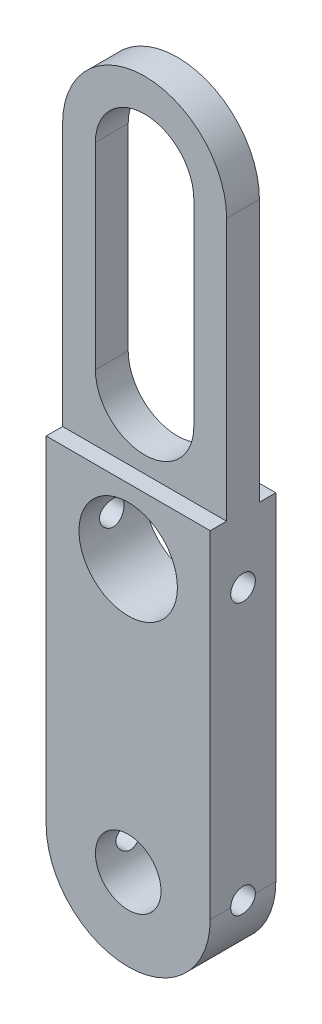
ISO-10303-21;
HEADER;
FILE_DESCRIPTION(('STEP AP214'),'2;1');
FILE_NAME('part.step','',(''),(''),'','','');
FILE_SCHEMA(('AUTOMOTIVE_DESIGN { 1 0 10303 214 1 1 1 1 }'));
ENDSEC;
DATA;
#1=APPLICATION_CONTEXT('core data for automotive mechanical design processes');
#2=APPLICATION_PROTOCOL_DEFINITION('international standard','automotive_design',2000,#1);
#3=PRODUCT_CONTEXT('',#1,'mechanical');
#4=PRODUCT('Part','Part','',(#3));
#5=PRODUCT_RELATED_PRODUCT_CATEGORY('part','',(#4));
#6=PRODUCT_DEFINITION_FORMATION('','',#4);
#7=PRODUCT_DEFINITION_CONTEXT('part definition',#1,'design');
#8=PRODUCT_DEFINITION('design','',#6,#7);
#9=PRODUCT_DEFINITION_SHAPE('','',#8);
#10=(LENGTH_UNIT() NAMED_UNIT(*) SI_UNIT(.MILLI.,.METRE.));
#11=(NAMED_UNIT(*) PLANE_ANGLE_UNIT() SI_UNIT($,.RADIAN.));
#12=(NAMED_UNIT(*) SI_UNIT($,.STERADIAN.) SOLID_ANGLE_UNIT());
#13=UNCERTAINTY_MEASURE_WITH_UNIT(LENGTH_MEASURE(1.E-05),#10,'distance_accuracy_value','');
#14=(GEOMETRIC_REPRESENTATION_CONTEXT(3) GLOBAL_UNCERTAINTY_ASSIGNED_CONTEXT((#13)) GLOBAL_UNIT_ASSIGNED_CONTEXT((#10,
#11,#12)) REPRESENTATION_CONTEXT('',''));
#15=CARTESIAN_POINT('',(0.,0.,0.));
#16=DIRECTION('',(0.,0.,1.));
#17=DIRECTION('',(1.,0.,0.));
#18=AXIS2_PLACEMENT_3D('',#15,#16,#17);
#19=CARTESIAN_POINT('',(0.,31.75,3.175));
#20=DIRECTION('',(0.,0.,1.));
#21=DIRECTION('',(1.,0.,0.));
#22=AXIS2_PLACEMENT_3D('',#19,#20,#21);
#23=PLANE('',#22);
#24=CARTESIAN_POINT('',(0.,0.,3.175));
#25=DIRECTION('',(0.,0.,1.));
#26=DIRECTION('',(1.,0.,0.));
#27=AXIS2_PLACEMENT_3D('',#24,#25,#26);
#28=CIRCLE('',#27,4.7625);
#29=CARTESIAN_POINT('',(4.7625,0.,3.175));
#30=VERTEX_POINT('',#29);
#31=EDGE_CURVE('E287',#30,#30,#28,.T.);
#32=ORIENTED_EDGE('',*,*,#31,.F.);
#33=EDGE_LOOP('',(#32));
#34=FACE_BOUND('',#33,.T.);
#35=CARTESIAN_POINT('',(0.,-26.2382,3.175));
#36=DIRECTION('',(0.,0.,1.));
#37=DIRECTION('',(1.,0.,0.));
#38=AXIS2_PLACEMENT_3D('',#35,#36,#37);
#39=CIRCLE('',#38,3.175);
#40=CARTESIAN_POINT('',(3.175,-26.2382,3.175));
#41=VERTEX_POINT('',#40);
#42=EDGE_CURVE('E288',#41,#41,#39,.T.);
#43=ORIENTED_EDGE('',*,*,#42,.F.);
#44=EDGE_LOOP('',(#43));
#45=FACE_BOUND('',#44,.T.);
#46=DIRECTION('',(0.,1.,0.));
#47=VECTOR('',#46,1.);
#48=CARTESIAN_POINT('',(7.93749999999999,31.75,3.175));
#49=LINE('',#48,#47);
#50=CARTESIAN_POINT('',(7.93749999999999,-26.2382,3.175));
#51=VERTEX_POINT('',#50);
#52=CARTESIAN_POINT('',(7.93749999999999,6.35000000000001,3.175));
#53=VERTEX_POINT('',#52);
#54=EDGE_CURVE('E306',#51,#53,#49,.T.);
#55=ORIENTED_EDGE('',*,*,#54,.T.);
#56=DIRECTION('',(-1.,0.,0.));
#57=VECTOR('',#56,1.);
#58=CARTESIAN_POINT('',(0.,6.35,3.175));
#59=LINE('',#58,#57);
#60=CARTESIAN_POINT('',(-7.9375,6.35,3.175));
#61=VERTEX_POINT('',#60);
#62=EDGE_CURVE('E322',#53,#61,#59,.T.);
#63=ORIENTED_EDGE('',*,*,#62,.T.);
#64=DIRECTION('',(0.,-1.,0.));
#65=VECTOR('',#64,1.);
#66=CARTESIAN_POINT('',(-7.9375,31.75,3.175));
#67=LINE('',#66,#65);
#68=CARTESIAN_POINT('',(-7.93749999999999,-26.2382,3.175));
#69=VERTEX_POINT('',#68);
#70=EDGE_CURVE('E303',#61,#69,#67,.T.);
#71=ORIENTED_EDGE('',*,*,#70,.T.);
#72=CARTESIAN_POINT('',(0.,-26.2382,3.175));
#73=DIRECTION('',(0.,0.,1.));
#74=DIRECTION('',(1.,0.,0.));
#75=AXIS2_PLACEMENT_3D('',#72,#73,#74);
#76=CIRCLE('',#75,7.93749999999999);
#77=EDGE_CURVE('E160',#69,#51,#76,.T.);
#78=ORIENTED_EDGE('',*,*,#77,.T.);
#79=EDGE_LOOP('',(#55,#63,#71,#78));
#80=FACE_BOUND('',#79,.T.);
#81=ADVANCED_FACE('F36',(#34,#45,#80),#23,.T.);
#82=CARTESIAN_POINT('',(0.,31.75,3.175));
#83=DIRECTION('',(0.,0.,-1.));
#84=DIRECTION('',(-1.,0.,0.));
#85=AXIS2_PLACEMENT_3D('',#82,#83,#84);
#86=CYLINDRICAL_SURFACE('',#85,7.9375);
#87=CARTESIAN_POINT('',(0.,31.75,1.5875));
#88=DIRECTION('',(0.,0.,1.));
#89=DIRECTION('',(0.,-1.,0.));
#90=AXIS2_PLACEMENT_3D('',#87,#88,#89);
#91=CIRCLE('',#90,7.9375);
#92=CARTESIAN_POINT('',(7.9375,31.75,1.5875));
#93=VERTEX_POINT('',#92);
#94=CARTESIAN_POINT('',(-7.9375,31.75,1.5875));
#95=VERTEX_POINT('',#94);
#96=EDGE_CURVE('E344',#93,#95,#91,.T.);
#97=ORIENTED_EDGE('',*,*,#96,.F.);
#98=DIRECTION('',(0.,0.,-1.));
#99=VECTOR('',#98,1.);
#100=CARTESIAN_POINT('',(7.93749999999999,31.75,3.175));
#101=LINE('',#100,#99);
#102=CARTESIAN_POINT('',(7.9375,31.75,-1.5875));
#103=VERTEX_POINT('',#102);
#104=EDGE_CURVE('E308',#93,#103,#101,.T.);
#105=ORIENTED_EDGE('',*,*,#104,.T.);
#106=CARTESIAN_POINT('',(0.,31.75,-1.5875));
#107=DIRECTION('',(0.,0.,1.));
#108=DIRECTION('',(0.,-1.,0.));
#109=AXIS2_PLACEMENT_3D('',#106,#107,#108);
#110=CIRCLE('',#109,7.9375);
#111=CARTESIAN_POINT('',(-7.9375,31.75,-1.5875));
#112=VERTEX_POINT('',#111);
#113=EDGE_CURVE('E369',#103,#112,#110,.T.);
#114=ORIENTED_EDGE('',*,*,#113,.T.);
#115=DIRECTION('',(0.,0.,-1.));
#116=VECTOR('',#115,1.);
#117=CARTESIAN_POINT('',(-7.9375,31.75,3.175));
#118=LINE('',#117,#116);
#119=EDGE_CURVE('E161',#95,#112,#118,.T.);
#120=ORIENTED_EDGE('',*,*,#119,.F.);
#121=EDGE_LOOP('',(#97,#105,#114,#120));
#122=FACE_BOUND('',#121,.T.);
#123=ADVANCED_FACE('F38',(#122),#86,.T.);
#124=CARTESIAN_POINT('',(-7.9375,31.75,3.175));
#125=DIRECTION('',(1.,0.,0.));
#126=DIRECTION('',(0.,1.,0.));
#127=AXIS2_PLACEMENT_3D('',#124,#125,#126);
#128=PLANE('',#127);
#129=CARTESIAN_POINT('',(-7.9375,0.,0.));
#130=DIRECTION('',(1.,0.,0.));
#131=DIRECTION('',(0.,0.,-1.));
#132=AXIS2_PLACEMENT_3D('',#129,#130,#131);
#133=CIRCLE('',#132,1.190625);
#134=CARTESIAN_POINT('',(-7.9375,0.,-1.190625));
#135=VERTEX_POINT('',#134);
#136=EDGE_CURVE('E178',#135,#135,#133,.T.);
#137=ORIENTED_EDGE('',*,*,#136,.T.);
#138=EDGE_LOOP('',(#137));
#139=FACE_BOUND('',#138,.T.);
#140=DIRECTION('',(0.,0.,-1.));
#141=VECTOR('',#140,1.);
#142=CARTESIAN_POINT('',(-7.93749999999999,-26.2382,3.175));
#143=LINE('',#142,#141);
#144=CARTESIAN_POINT('',(-7.93749999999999,-26.2382,-1.190625));
#145=VERTEX_POINT('',#144);
#146=CARTESIAN_POINT('',(-7.93749999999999,-26.2382,-3.175));
#147=VERTEX_POINT('',#146);
#148=EDGE_CURVE('E155',#145,#147,#143,.T.);
#149=ORIENTED_EDGE('',*,*,#148,.F.);
#150=CARTESIAN_POINT('',(-7.9375,-26.2382,0.));
#151=DIRECTION('',(1.,0.,0.));
#152=DIRECTION('',(0.,0.,-1.));
#153=AXIS2_PLACEMENT_3D('',#150,#151,#152);
#154=CIRCLE('',#153,1.190625);
#155=CARTESIAN_POINT('',(-7.9375,-26.2382,1.190625));
#156=VERTEX_POINT('',#155);
#157=EDGE_CURVE('E56',#145,#156,#154,.T.);
#158=ORIENTED_EDGE('',*,*,#157,.T.);
#159=EDGE_CURVE('E152',#69,#156,#143,.T.);
#160=ORIENTED_EDGE('',*,*,#159,.F.);
#161=ORIENTED_EDGE('',*,*,#70,.F.);
#162=DIRECTION('',(0.,0.,1.));
#163=VECTOR('',#162,1.);
#164=CARTESIAN_POINT('',(-7.9375,6.35,1.5875));
#165=LINE('',#164,#163);
#166=CARTESIAN_POINT('',(-7.9375,6.35,1.5875));
#167=VERTEX_POINT('',#166);
#168=EDGE_CURVE('E325',#167,#61,#165,.T.);
#169=ORIENTED_EDGE('',*,*,#168,.F.);
#170=DIRECTION('',(0.,-1.,0.));
#171=VECTOR('',#170,1.);
#172=CARTESIAN_POINT('',(-7.9375,44.45,1.58749999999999));
#173=LINE('',#172,#171);
#174=EDGE_CURVE('E326',#95,#167,#173,.T.);
#175=ORIENTED_EDGE('',*,*,#174,.F.);
#176=ORIENTED_EDGE('',*,*,#119,.T.);
#177=DIRECTION('',(0.,-1.,0.));
#178=VECTOR('',#177,1.);
#179=CARTESIAN_POINT('',(-7.9375,44.45,-1.58749999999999));
#180=LINE('',#179,#178);
#181=CARTESIAN_POINT('',(-7.9375,6.35,-1.5875));
#182=VERTEX_POINT('',#181);
#183=EDGE_CURVE('E352',#112,#182,#180,.T.);
#184=ORIENTED_EDGE('',*,*,#183,.T.);
#185=DIRECTION('',(0.,0.,-1.));
#186=VECTOR('',#185,1.);
#187=CARTESIAN_POINT('',(-7.9375,6.35,-1.5875));
#188=LINE('',#187,#186);
#189=CARTESIAN_POINT('',(-7.9375,6.35,-3.175));
#190=VERTEX_POINT('',#189);
#191=EDGE_CURVE('E355',#182,#190,#188,.T.);
#192=ORIENTED_EDGE('',*,*,#191,.T.);
#193=DIRECTION('',(0.,-1.,0.));
#194=VECTOR('',#193,1.);
#195=CARTESIAN_POINT('',(-7.9375,31.75,-3.175));
#196=LINE('',#195,#194);
#197=EDGE_CURVE('E282',#190,#147,#196,.T.);
#198=ORIENTED_EDGE('',*,*,#197,.T.);
#199=EDGE_LOOP('',(#149,#158,#160,#161,#169,#175,#176,#184,#192,#198));
#200=FACE_BOUND('',#199,.T.);
#201=ADVANCED_FACE('F150',(#139,#200),#128,.F.);
#202=CARTESIAN_POINT('',(7.93749999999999,31.75,3.175));
#203=DIRECTION('',(-1.,0.,0.));
#204=DIRECTION('',(0.,-1.,0.));
#205=AXIS2_PLACEMENT_3D('',#202,#203,#204);
#206=PLANE('',#205);
#207=CARTESIAN_POINT('',(7.9375,0.,0.));
#208=DIRECTION('',(1.,0.,0.));
#209=DIRECTION('',(0.,0.,-1.));
#210=AXIS2_PLACEMENT_3D('',#207,#208,#209);
#211=CIRCLE('',#210,1.190625);
#212=CARTESIAN_POINT('',(7.9375,0.,-1.190625));
#213=VERTEX_POINT('',#212);
#214=EDGE_CURVE('E145',#213,#213,#211,.T.);
#215=ORIENTED_EDGE('',*,*,#214,.F.);
#216=EDGE_LOOP('',(#215));
#217=FACE_BOUND('',#216,.T.);
#218=DIRECTION('',(0.,0.,-1.));
#219=VECTOR('',#218,1.);
#220=CARTESIAN_POINT('',(7.93749999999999,-26.2382,3.175));
#221=LINE('',#220,#219);
#222=CARTESIAN_POINT('',(7.93749999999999,-26.2382,1.190625));
#223=VERTEX_POINT('',#222);
#224=EDGE_CURVE('E164',#51,#223,#221,.T.);
#225=ORIENTED_EDGE('',*,*,#224,.T.);
#226=CARTESIAN_POINT('',(7.9375,-26.2382,0.));
#227=DIRECTION('',(1.,0.,0.));
#228=DIRECTION('',(0.,0.,-1.));
#229=AXIS2_PLACEMENT_3D('',#226,#227,#228);
#230=CIRCLE('',#229,1.190625);
#231=CARTESIAN_POINT('',(7.9375,-26.2382,-1.190625));
#232=VERTEX_POINT('',#231);
#233=EDGE_CURVE('E63',#232,#223,#230,.T.);
#234=ORIENTED_EDGE('',*,*,#233,.F.);
#235=CARTESIAN_POINT('',(7.93749999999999,-26.2382,-3.175));
#236=VERTEX_POINT('',#235);
#237=EDGE_CURVE('E309',#232,#236,#221,.T.);
#238=ORIENTED_EDGE('',*,*,#237,.T.);
#239=DIRECTION('',(0.,1.,0.));
#240=VECTOR('',#239,1.);
#241=CARTESIAN_POINT('',(7.93749999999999,31.75,-3.175));
#242=LINE('',#241,#240);
#243=CARTESIAN_POINT('',(7.9375,6.35,-3.175));
#244=VERTEX_POINT('',#243);
#245=EDGE_CURVE('E300',#236,#244,#242,.T.);
#246=ORIENTED_EDGE('',*,*,#245,.T.);
#247=DIRECTION('',(0.,0.,-1.));
#248=VECTOR('',#247,1.);
#249=CARTESIAN_POINT('',(7.9375,6.35,-1.5875));
#250=LINE('',#249,#248);
#251=CARTESIAN_POINT('',(7.93749999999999,6.35,-1.5875));
#252=VERTEX_POINT('',#251);
#253=EDGE_CURVE('E350',#252,#244,#250,.T.);
#254=ORIENTED_EDGE('',*,*,#253,.F.);
#255=DIRECTION('',(0.,-1.,0.));
#256=VECTOR('',#255,1.);
#257=CARTESIAN_POINT('',(7.9375,44.45,-1.58749999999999));
#258=LINE('',#257,#256);
#259=EDGE_CURVE('E347',#103,#252,#258,.T.);
#260=ORIENTED_EDGE('',*,*,#259,.F.);
#261=ORIENTED_EDGE('',*,*,#104,.F.);
#262=DIRECTION('',(0.,-1.,0.));
#263=VECTOR('',#262,1.);
#264=CARTESIAN_POINT('',(7.9375,44.45,1.58749999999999));
#265=LINE('',#264,#263);
#266=CARTESIAN_POINT('',(7.9375,6.35,1.5875));
#267=VERTEX_POINT('',#266);
#268=EDGE_CURVE('E390',#93,#267,#265,.T.);
#269=ORIENTED_EDGE('',*,*,#268,.T.);
#270=DIRECTION('',(0.,0.,1.));
#271=VECTOR('',#270,1.);
#272=CARTESIAN_POINT('',(7.9375,6.35,1.5875));
#273=LINE('',#272,#271);
#274=EDGE_CURVE('E319',#267,#53,#273,.T.);
#275=ORIENTED_EDGE('',*,*,#274,.T.);
#276=ORIENTED_EDGE('',*,*,#54,.F.);
#277=EDGE_LOOP('',(#225,#234,#238,#246,#254,#260,#261,#269,#275,#276));
#278=FACE_BOUND('',#277,.T.);
#279=ADVANCED_FACE('F224',(#217,#278),#206,.F.);
#280=CARTESIAN_POINT('',(0.,31.75,3.175));
#281=DIRECTION('',(0.,0.,-1.));
#282=DIRECTION('',(-1.,0.,0.));
#283=AXIS2_PLACEMENT_3D('',#280,#281,#282);
#284=CYLINDRICAL_SURFACE('',#283,4.7625);
#285=DIRECTION('',(0.,0.,-1.));
#286=VECTOR('',#285,1.);
#287=CARTESIAN_POINT('',(4.7625,31.75,3.175));
#288=LINE('',#287,#286);
#289=CARTESIAN_POINT('',(4.7625,31.75,1.5875));
#290=VERTEX_POINT('',#289);
#291=CARTESIAN_POINT('',(4.7625,31.75,-1.5875));
#292=VERTEX_POINT('',#291);
#293=EDGE_CURVE('E373',#290,#292,#288,.T.);
#294=ORIENTED_EDGE('',*,*,#293,.F.);
#295=CARTESIAN_POINT('',(0.,31.75,1.5875));
#296=DIRECTION('',(0.,0.,1.));
#297=DIRECTION('',(0.,-1.,0.));
#298=AXIS2_PLACEMENT_3D('',#295,#296,#297);
#299=CIRCLE('',#298,4.7625);
#300=CARTESIAN_POINT('',(-4.7625,31.75,1.5875));
#301=VERTEX_POINT('',#300);
#302=EDGE_CURVE('E341',#290,#301,#299,.T.);
#303=ORIENTED_EDGE('',*,*,#302,.T.);
#304=DIRECTION('',(0.,0.,-1.));
#305=VECTOR('',#304,1.);
#306=CARTESIAN_POINT('',(-4.7625,31.75,3.175));
#307=LINE('',#306,#305);
#308=CARTESIAN_POINT('',(-4.7625,31.75,-1.5875));
#309=VERTEX_POINT('',#308);
#310=EDGE_CURVE('E379',#301,#309,#307,.T.);
#311=ORIENTED_EDGE('',*,*,#310,.T.);
#312=CARTESIAN_POINT('',(0.,31.75,-1.5875));
#313=DIRECTION('',(0.,0.,1.));
#314=DIRECTION('',(0.,-1.,0.));
#315=AXIS2_PLACEMENT_3D('',#312,#313,#314);
#316=CIRCLE('',#315,4.7625);
#317=EDGE_CURVE('E366',#292,#309,#316,.T.);
#318=ORIENTED_EDGE('',*,*,#317,.F.);
#319=EDGE_LOOP('',(#294,#303,#311,#318));
#320=FACE_BOUND('',#319,.T.);
#321=ADVANCED_FACE('F221',(#320),#284,.F.);
#322=CARTESIAN_POINT('',(-4.7625,31.75,3.175));
#323=DIRECTION('',(1.,0.,0.));
#324=DIRECTION('',(0.,0.,-1.));
#325=AXIS2_PLACEMENT_3D('',#322,#323,#324);
#326=PLANE('',#325);
#327=ORIENTED_EDGE('',*,*,#310,.F.);
#328=DIRECTION('',(0.,-1.,0.));
#329=VECTOR('',#328,1.);
#330=CARTESIAN_POINT('',(-4.7625,31.75,1.5875));
#331=LINE('',#330,#329);
#332=CARTESIAN_POINT('',(-4.7625,12.7,1.5875));
#333=VERTEX_POINT('',#332);
#334=EDGE_CURVE('E338',#301,#333,#331,.T.);
#335=ORIENTED_EDGE('',*,*,#334,.T.);
#336=DIRECTION('',(0.,0.,-1.));
#337=VECTOR('',#336,1.);
#338=CARTESIAN_POINT('',(-4.7625,12.7,3.175));
#339=LINE('',#338,#337);
#340=CARTESIAN_POINT('',(-4.7625,12.7,-1.5875));
#341=VERTEX_POINT('',#340);
#342=EDGE_CURVE('E377',#333,#341,#339,.T.);
#343=ORIENTED_EDGE('',*,*,#342,.T.);
#344=DIRECTION('',(0.,-1.,0.));
#345=VECTOR('',#344,1.);
#346=CARTESIAN_POINT('',(-4.7625,31.75,-1.5875));
#347=LINE('',#346,#345);
#348=EDGE_CURVE('E363',#309,#341,#347,.T.);
#349=ORIENTED_EDGE('',*,*,#348,.F.);
#350=EDGE_LOOP('',(#327,#335,#343,#349));
#351=FACE_BOUND('',#350,.T.);
#352=ADVANCED_FACE('F217',(#351),#326,.T.);
#353=CARTESIAN_POINT('',(0.,12.7,3.175));
#354=DIRECTION('',(0.,0.,-1.));
#355=DIRECTION('',(-1.,0.,0.));
#356=AXIS2_PLACEMENT_3D('',#353,#354,#355);
#357=CYLINDRICAL_SURFACE('',#356,4.7625);
#358=ORIENTED_EDGE('',*,*,#342,.F.);
#359=CARTESIAN_POINT('',(0.,12.7,1.5875));
#360=DIRECTION('',(0.,0.,1.));
#361=DIRECTION('',(0.,-1.,0.));
#362=AXIS2_PLACEMENT_3D('',#359,#360,#361);
#363=CIRCLE('',#362,4.7625);
#364=CARTESIAN_POINT('',(4.7625,12.7,1.5875));
#365=VERTEX_POINT('',#364);
#366=EDGE_CURVE('E331',#333,#365,#363,.T.);
#367=ORIENTED_EDGE('',*,*,#366,.T.);
#368=DIRECTION('',(0.,0.,-1.));
#369=VECTOR('',#368,1.);
#370=CARTESIAN_POINT('',(4.7625,12.7,3.175));
#371=LINE('',#370,#369);
#372=CARTESIAN_POINT('',(4.7625,12.7,-1.5875));
#373=VERTEX_POINT('',#372);
#374=EDGE_CURVE('E375',#365,#373,#371,.T.);
#375=ORIENTED_EDGE('',*,*,#374,.T.);
#376=CARTESIAN_POINT('',(0.,12.7,-1.5875));
#377=DIRECTION('',(0.,0.,1.));
#378=DIRECTION('',(0.,-1.,0.));
#379=AXIS2_PLACEMENT_3D('',#376,#377,#378);
#380=CIRCLE('',#379,4.7625);
#381=EDGE_CURVE('E360',#341,#373,#380,.T.);
#382=ORIENTED_EDGE('',*,*,#381,.F.);
#383=EDGE_LOOP('',(#358,#367,#375,#382));
#384=FACE_BOUND('',#383,.T.);
#385=ADVANCED_FACE('F213',(#384),#357,.F.);
#386=CARTESIAN_POINT('',(4.7625,31.75,3.175));
#387=DIRECTION('',(-1.,0.,0.));
#388=DIRECTION('',(0.,0.,1.));
#389=AXIS2_PLACEMENT_3D('',#386,#387,#388);
#390=PLANE('',#389);
#391=ORIENTED_EDGE('',*,*,#374,.F.);
#392=DIRECTION('',(0.,1.,0.));
#393=VECTOR('',#392,1.);
#394=CARTESIAN_POINT('',(4.7625,31.75,1.5875));
#395=LINE('',#394,#393);
#396=EDGE_CURVE('E11',#365,#290,#395,.T.);
#397=ORIENTED_EDGE('',*,*,#396,.T.);
#398=ORIENTED_EDGE('',*,*,#293,.T.);
#399=DIRECTION('',(0.,1.,0.));
#400=VECTOR('',#399,1.);
#401=CARTESIAN_POINT('',(4.7625,31.75,-1.5875));
#402=LINE('',#401,#400);
#403=EDGE_CURVE('E49',#373,#292,#402,.T.);
#404=ORIENTED_EDGE('',*,*,#403,.F.);
#405=EDGE_LOOP('',(#391,#397,#398,#404));
#406=FACE_BOUND('',#405,.T.);
#407=ADVANCED_FACE('F209',(#406),#390,.T.);
#408=CARTESIAN_POINT('',(0.,31.75,-3.175));
#409=DIRECTION('',(0.,0.,1.));
#410=DIRECTION('',(1.,0.,0.));
#411=AXIS2_PLACEMENT_3D('',#408,#409,#410);
#412=PLANE('',#411);
#413=CARTESIAN_POINT('',(0.,-26.2382,-3.175));
#414=DIRECTION('',(0.,0.,1.));
#415=DIRECTION('',(1.,0.,0.));
#416=AXIS2_PLACEMENT_3D('',#413,#414,#415);
#417=CIRCLE('',#416,3.175);
#418=CARTESIAN_POINT('',(3.175,-26.2382,-3.175));
#419=VERTEX_POINT('',#418);
#420=EDGE_CURVE('E277',#419,#419,#417,.T.);
#421=ORIENTED_EDGE('',*,*,#420,.T.);
#422=EDGE_LOOP('',(#421));
#423=FACE_BOUND('',#422,.T.);
#424=ORIENTED_EDGE('',*,*,#197,.F.);
#425=DIRECTION('',(1.,0.,0.));
#426=VECTOR('',#425,1.);
#427=CARTESIAN_POINT('',(0.,6.35,-3.175));
#428=LINE('',#427,#426);
#429=EDGE_CURVE('E371',#190,#244,#428,.T.);
#430=ORIENTED_EDGE('',*,*,#429,.T.);
#431=ORIENTED_EDGE('',*,*,#245,.F.);
#432=CARTESIAN_POINT('',(0.,-26.2382,-3.175));
#433=DIRECTION('',(0.,0.,1.));
#434=DIRECTION('',(1.,0.,0.));
#435=AXIS2_PLACEMENT_3D('',#432,#433,#434);
#436=CIRCLE('',#435,7.93749999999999);
#437=EDGE_CURVE('E297',#147,#236,#436,.T.);
#438=ORIENTED_EDGE('',*,*,#437,.F.);
#439=EDGE_LOOP('',(#424,#430,#431,#438));
#440=FACE_BOUND('',#439,.T.);
#441=CARTESIAN_POINT('',(0.,0.,-3.175));
#442=DIRECTION('',(0.,0.,1.));
#443=DIRECTION('',(1.,0.,0.));
#444=AXIS2_PLACEMENT_3D('',#441,#442,#443);
#445=CIRCLE('',#444,4.7625);
#446=CARTESIAN_POINT('',(4.7625,0.,-3.175));
#447=VERTEX_POINT('',#446);
#448=EDGE_CURVE('E285',#447,#447,#445,.T.);
#449=ORIENTED_EDGE('',*,*,#448,.T.);
#450=EDGE_LOOP('',(#449));
#451=FACE_BOUND('',#450,.T.);
#452=ADVANCED_FACE('F212',(#423,#440,#451),#412,.F.);
#453=CARTESIAN_POINT('',(0.,-26.2382,3.175));
#454=DIRECTION('',(0.,0.,-1.));
#455=DIRECTION('',(-1.,0.,0.));
#456=AXIS2_PLACEMENT_3D('',#453,#454,#455);
#457=CYLINDRICAL_SURFACE('',#456,7.93749999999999);
#458=ORIENTED_EDGE('',*,*,#159,.T.);
#459=CARTESIAN_POINT('',(-7.93749999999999,-26.2382,1.190625));
#460=CARTESIAN_POINT('',(-7.93750116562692,-26.27149850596,1.19062499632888));
#461=CARTESIAN_POINT('',(-7.93729020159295,-26.304780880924,1.18922721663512));
#462=CARTESIAN_POINT('',(-7.9364563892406,-26.371103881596,1.18365234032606));
#463=CARTESIAN_POINT('',(-7.93583357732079,-26.4041445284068,1.17947548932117));
#464=CARTESIAN_POINT('',(-7.93336923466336,-26.5024643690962,1.16282303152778));
#465=CARTESIAN_POINT('',(-7.93093169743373,-26.5670792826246,1.14622536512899));
#466=CARTESIAN_POINT('',(-7.92473458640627,-26.6925650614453,1.10252536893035));
#467=CARTESIAN_POINT('',(-7.92097465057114,-26.7534348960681,1.07542016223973));
#468=CARTESIAN_POINT('',(-7.91254874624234,-26.8697701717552,1.01148896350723));
#469=CARTESIAN_POINT('',(-7.90788280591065,-26.9252357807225,0.974663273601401));
#470=CARTESIAN_POINT('',(-7.89812367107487,-27.0296040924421,0.892036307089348));
#471=CARTESIAN_POINT('',(-7.89302775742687,-27.0784590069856,0.846175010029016));
#472=CARTESIAN_POINT('',(-7.88300368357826,-27.1678158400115,0.746902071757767));
#473=CARTESIAN_POINT('',(-7.87807554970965,-27.2083164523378,0.693489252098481));
#474=CARTESIAN_POINT('',(-7.86891889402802,-27.2799958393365,0.580308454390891));
#475=CARTESIAN_POINT('',(-7.86469392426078,-27.3111278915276,0.520510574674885));
#476=CARTESIAN_POINT('',(-7.85745975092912,-27.362886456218,0.396464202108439));
#477=CARTESIAN_POINT('',(-7.85445041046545,-27.3835141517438,0.332216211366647));
#478=CARTESIAN_POINT('',(-7.85001493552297,-27.4135308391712,0.20159896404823));
#479=CARTESIAN_POINT('',(-7.84857714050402,-27.4230026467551,0.135249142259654));
#480=CARTESIAN_POINT('',(-7.84741213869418,-27.4306953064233,0.00188584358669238));
#481=CARTESIAN_POINT('',(-7.84768487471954,-27.4289165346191,-0.0651276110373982));
#482=CARTESIAN_POINT('',(-7.84989951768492,-27.4142257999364,-0.19732730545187));
#483=CARTESIAN_POINT('',(-7.8518275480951,-27.4014063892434,-0.262524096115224));
#484=CARTESIAN_POINT('',(-7.85711384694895,-27.3651432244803,-0.389830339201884));
#485=CARTESIAN_POINT('',(-7.86047214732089,-27.3416992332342,-0.451939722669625));
#486=CARTESIAN_POINT('',(-7.868255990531,-27.2847556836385,-0.571591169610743));
#487=CARTESIAN_POINT('',(-7.87268570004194,-27.2512167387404,-0.629114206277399));
#488=CARTESIAN_POINT('',(-7.88211000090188,-27.175064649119,-0.737748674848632));
#489=CARTESIAN_POINT('',(-7.88710460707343,-27.1324512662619,-0.788859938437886));
#490=CARTESIAN_POINT('',(-7.89715672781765,-27.0388585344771,-0.883752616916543));
#491=CARTESIAN_POINT('',(-7.90221437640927,-26.9878006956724,-0.927456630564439));
#492=CARTESIAN_POINT('',(-7.91177841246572,-26.8790154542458,-1.00569998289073));
#493=CARTESIAN_POINT('',(-7.91628464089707,-26.8212861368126,-1.04023668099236));
#494=CARTESIAN_POINT('',(-7.92424341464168,-26.7007217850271,-1.09916876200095));
#495=CARTESIAN_POINT('',(-7.92769472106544,-26.6378808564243,-1.12355223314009));
#496=CARTESIAN_POINT('',(-7.93314105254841,-26.5089769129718,-1.16136307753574));
#497=CARTESIAN_POINT('',(-7.93513825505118,-26.4429188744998,-1.17480683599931));
#498=CARTESIAN_POINT('',(-7.93669840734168,-26.3533418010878,-1.18527062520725));
#499=CARTESIAN_POINT('',(-7.93699877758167,-26.3303398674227,-1.18727941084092));
#500=CARTESIAN_POINT('',(-7.93739935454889,-26.2842952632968,-1.18995482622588));
#501=CARTESIAN_POINT('',(-7.9374998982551,-26.2612527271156,-1.19062371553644));
#502=CARTESIAN_POINT('',(-7.93749999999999,-26.2382,-1.190625));
#503=B_SPLINE_CURVE_WITH_KNOTS('',3,(#459,#460,#461,#462,#463,#464,#465,#466,#467,#468,#469,
#470,#471,#472,#473,#474,#475,#476,#477,#478,#479,#480,#481,#482,#483,#484,#485,#486,#487,#488,
#489,#490,#491,#492,#493,#494,#495,#496,#497,#498,#499,#500,#501,#502),.UNSPECIFIED.,.F.,.F.,(4,
2,2,2,2,2,2,2,2,2,2,2,2,2,2,2,2,2,2,2,2,4),(0.,0.0998335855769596,0.199658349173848,
0.398899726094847,0.598195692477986,0.797485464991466,0.998146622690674,1.1988391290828,
1.40051653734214,1.60217122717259,1.80231930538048,2.00246069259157,2.20094047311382,
2.39942468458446,2.59869356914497,2.79796768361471,2.99921046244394,3.20051114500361,
3.40204733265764,3.60328110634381,3.67252588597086,3.74165379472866),.UNSPECIFIED.);
#504=EDGE_CURVE('E140',#156,#145,#503,.T.);
#505=ORIENTED_EDGE('',*,*,#504,.T.);
#506=ORIENTED_EDGE('',*,*,#148,.T.);
#507=ORIENTED_EDGE('',*,*,#437,.T.);
#508=ORIENTED_EDGE('',*,*,#237,.F.);
#509=CARTESIAN_POINT('',(7.93749999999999,-26.2382,-1.190625));
#510=CARTESIAN_POINT('',(7.93750116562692,-26.27149850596,-1.19062499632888));
#511=CARTESIAN_POINT('',(7.93729020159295,-26.304780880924,-1.18922721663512));
#512=CARTESIAN_POINT('',(7.9364563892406,-26.371103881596,-1.18365234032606));
#513=CARTESIAN_POINT('',(7.93583357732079,-26.4041445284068,-1.17947548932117));
#514=CARTESIAN_POINT('',(7.93336923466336,-26.5024643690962,-1.16282303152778));
#515=CARTESIAN_POINT('',(7.93093169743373,-26.5670792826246,-1.14622536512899));
#516=CARTESIAN_POINT('',(7.92473458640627,-26.6925650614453,-1.10252536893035));
#517=CARTESIAN_POINT('',(7.92097465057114,-26.7534348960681,-1.07542016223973));
#518=CARTESIAN_POINT('',(7.91254874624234,-26.8697701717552,-1.01148896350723));
#519=CARTESIAN_POINT('',(7.90788280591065,-26.9252357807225,-0.974663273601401));
#520=CARTESIAN_POINT('',(7.89812367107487,-27.0296040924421,-0.892036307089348));
#521=CARTESIAN_POINT('',(7.89302775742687,-27.0784590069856,-0.846175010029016));
#522=CARTESIAN_POINT('',(7.88300368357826,-27.1678158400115,-0.746902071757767));
#523=CARTESIAN_POINT('',(7.87807554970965,-27.2083164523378,-0.693489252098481));
#524=CARTESIAN_POINT('',(7.86891889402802,-27.2799958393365,-0.580308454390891));
#525=CARTESIAN_POINT('',(7.86469392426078,-27.3111278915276,-0.520510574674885));
#526=CARTESIAN_POINT('',(7.85745975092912,-27.362886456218,-0.396464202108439));
#527=CARTESIAN_POINT('',(7.85445041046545,-27.3835141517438,-0.332216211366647));
#528=CARTESIAN_POINT('',(7.85001493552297,-27.4135308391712,-0.20159896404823));
#529=CARTESIAN_POINT('',(7.84857714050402,-27.4230026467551,-0.135249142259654));
#530=CARTESIAN_POINT('',(7.84741213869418,-27.4306953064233,-0.00188584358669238));
#531=CARTESIAN_POINT('',(7.84768487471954,-27.4289165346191,0.0651276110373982));
#532=CARTESIAN_POINT('',(7.84989951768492,-27.4142257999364,0.19732730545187));
#533=CARTESIAN_POINT('',(7.8518275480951,-27.4014063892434,0.262524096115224));
#534=CARTESIAN_POINT('',(7.85711384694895,-27.3651432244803,0.389830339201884));
#535=CARTESIAN_POINT('',(7.86047214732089,-27.3416992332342,0.451939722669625));
#536=CARTESIAN_POINT('',(7.868255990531,-27.2847556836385,0.571591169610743));
#537=CARTESIAN_POINT('',(7.87268570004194,-27.2512167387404,0.629114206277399));
#538=CARTESIAN_POINT('',(7.88211000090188,-27.175064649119,0.737748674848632));
#539=CARTESIAN_POINT('',(7.88710460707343,-27.1324512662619,0.788859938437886));
#540=CARTESIAN_POINT('',(7.89715672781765,-27.0388585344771,0.883752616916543));
#541=CARTESIAN_POINT('',(7.90221437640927,-26.9878006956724,0.927456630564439));
#542=CARTESIAN_POINT('',(7.91177841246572,-26.8790154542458,1.00569998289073));
#543=CARTESIAN_POINT('',(7.91628464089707,-26.8212861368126,1.04023668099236));
#544=CARTESIAN_POINT('',(7.92424341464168,-26.7007217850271,1.09916876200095));
#545=CARTESIAN_POINT('',(7.92769472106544,-26.6378808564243,1.12355223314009));
#546=CARTESIAN_POINT('',(7.93314105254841,-26.5089769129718,1.16136307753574));
#547=CARTESIAN_POINT('',(7.93513825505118,-26.4429188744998,1.17480683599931));
#548=CARTESIAN_POINT('',(7.93669840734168,-26.3533418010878,1.18527062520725));
#549=CARTESIAN_POINT('',(7.93699877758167,-26.3303398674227,1.18727941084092));
#550=CARTESIAN_POINT('',(7.93739935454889,-26.2842952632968,1.18995482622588));
#551=CARTESIAN_POINT('',(7.9374998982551,-26.2612527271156,1.19062371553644));
#552=CARTESIAN_POINT('',(7.93749999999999,-26.2382,1.190625));
#553=B_SPLINE_CURVE_WITH_KNOTS('',3,(#509,#510,#511,#512,#513,#514,#515,#516,#517,#518,#519,
#520,#521,#522,#523,#524,#525,#526,#527,#528,#529,#530,#531,#532,#533,#534,#535,#536,#537,#538,
#539,#540,#541,#542,#543,#544,#545,#546,#547,#548,#549,#550,#551,#552),.UNSPECIFIED.,.F.,.F.,(4,
2,2,2,2,2,2,2,2,2,2,2,2,2,2,2,2,2,2,2,2,4),(0.,0.0998335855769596,0.199658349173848,
0.398899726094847,0.598195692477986,0.797485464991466,0.998146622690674,1.1988391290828,
1.40051653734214,1.60217122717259,1.80231930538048,2.00246069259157,2.20094047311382,
2.39942468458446,2.59869356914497,2.79796768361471,2.99921046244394,3.20051114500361,
3.40204733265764,3.60328110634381,3.67252588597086,3.74165379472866),.UNSPECIFIED.);
#554=EDGE_CURVE('E146',#232,#223,#553,.T.);
#555=ORIENTED_EDGE('',*,*,#554,.T.);
#556=ORIENTED_EDGE('',*,*,#224,.F.);
#557=ORIENTED_EDGE('',*,*,#77,.F.);
#558=EDGE_LOOP('',(#458,#505,#506,#507,#508,#555,#556,#557));
#559=FACE_BOUND('',#558,.T.);
#560=ADVANCED_FACE('F158',(#559),#457,.T.);
#561=CARTESIAN_POINT('',(0.,0.,3.175));
#562=DIRECTION('',(0.,0.,-1.));
#563=DIRECTION('',(-1.,0.,0.));
#564=AXIS2_PLACEMENT_3D('',#561,#562,#563);
#565=CYLINDRICAL_SURFACE('',#564,4.7625);
#566=CARTESIAN_POINT('',(-4.7625,0.,1.190625));
#567=CARTESIAN_POINT('',(-4.76249888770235,-0.0657828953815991,1.19062315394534));
#568=CARTESIAN_POINT('',(-4.76112346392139,-0.131586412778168,1.18515483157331));
#569=CARTESIAN_POINT('',(-4.75576990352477,-0.26130751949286,1.16345878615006));
#570=CARTESIAN_POINT('',(-4.751790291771,-0.325224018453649,1.14722496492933));
#571=CARTESIAN_POINT('',(-4.74166903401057,-0.44927906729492,1.10455134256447));
#572=CARTESIAN_POINT('',(-4.73552998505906,-0.509422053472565,1.07812379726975));
#573=CARTESIAN_POINT('',(-4.72174366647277,-0.624421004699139,1.01585602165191));
#574=CARTESIAN_POINT('',(-4.71409634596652,-0.679276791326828,0.980015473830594));
#575=CARTESIAN_POINT('',(-4.69794759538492,-0.783274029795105,0.89915937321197));
#576=CARTESIAN_POINT('',(-4.68943298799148,-0.832291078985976,0.853986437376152));
#577=CARTESIAN_POINT('',(-4.67259685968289,-0.922138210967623,0.756084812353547));
#578=CARTESIAN_POINT('',(-4.66427536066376,-0.962967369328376,0.703355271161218));
#579=CARTESIAN_POINT('',(-4.64863478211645,-1.03586481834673,0.59087128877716));
#580=CARTESIAN_POINT('',(-4.64133243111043,-1.06779394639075,0.531024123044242));
#581=CARTESIAN_POINT('',(-4.62874911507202,-1.12109004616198,0.406599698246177));
#582=CARTESIAN_POINT('',(-4.62346782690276,-1.14245870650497,0.342023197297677));
#583=CARTESIAN_POINT('',(-4.61566003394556,-1.17360290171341,0.211341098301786));
#584=CARTESIAN_POINT('',(-4.61308046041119,-1.18360211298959,0.145292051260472));
#585=CARTESIAN_POINT('',(-4.61080931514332,-1.19242028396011,0.0124074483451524));
#586=CARTESIAN_POINT('',(-4.61111727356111,-1.19124106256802,-0.054427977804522));
#587=CARTESIAN_POINT('',(-4.61453869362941,-1.17791430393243,-0.185273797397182));
#588=CARTESIAN_POINT('',(-4.61758397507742,-1.16603330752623,-0.24931339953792));
#589=CARTESIAN_POINT('',(-4.62602825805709,-1.13206544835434,-0.374460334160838));
#590=CARTESIAN_POINT('',(-4.6314274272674,-1.1099778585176,-0.435567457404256));
#591=CARTESIAN_POINT('',(-4.64403371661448,-1.05599664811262,-0.553829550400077));
#592=CARTESIAN_POINT('',(-4.65125853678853,-1.02400629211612,-0.610938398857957));
#593=CARTESIAN_POINT('',(-4.66669207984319,-0.95119529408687,-0.719072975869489));
#594=CARTESIAN_POINT('',(-4.67490097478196,-0.910373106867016,-0.770097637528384));
#595=CARTESIAN_POINT('',(-4.69166480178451,-0.819676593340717,-0.866142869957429));
#596=CARTESIAN_POINT('',(-4.7002229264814,-0.769577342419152,-0.910950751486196));
#597=CARTESIAN_POINT('',(-4.71650985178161,-0.662473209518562,-0.991569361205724));
#598=CARTESIAN_POINT('',(-4.72423862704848,-0.605468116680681,-1.02737981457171));
#599=CARTESIAN_POINT('',(-4.73803449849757,-0.485866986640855,-1.08906515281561));
#600=CARTESIAN_POINT('',(-4.74409579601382,-0.423252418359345,-1.11490548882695));
#601=CARTESIAN_POINT('',(-4.75383159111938,-0.294382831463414,-1.15563436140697));
#602=CARTESIAN_POINT('',(-4.75750654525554,-0.228128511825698,-1.1705249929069));
#603=CARTESIAN_POINT('',(-4.76198802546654,-0.0956786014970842,-1.18860694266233));
#604=CARTESIAN_POINT('',(-4.76286554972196,-0.029524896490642,-1.19208790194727));
#605=CARTESIAN_POINT('',(-4.7618555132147,0.102419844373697,-1.18804610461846));
#606=CARTESIAN_POINT('',(-4.75996820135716,0.168210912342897,-1.18052433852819));
#607=CARTESIAN_POINT('',(-4.75368605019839,0.29655632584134,-1.15492934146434));
#608=CARTESIAN_POINT('',(-4.74932878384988,0.359144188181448,-1.13701412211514));
#609=CARTESIAN_POINT('',(-4.73859785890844,0.48042297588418,-1.09132125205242));
#610=CARTESIAN_POINT('',(-4.73222399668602,0.539113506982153,-1.06354260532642));
#611=CARTESIAN_POINT('',(-4.71799688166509,0.652083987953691,-0.998350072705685));
#612=CARTESIAN_POINT('',(-4.71011938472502,0.70626719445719,-0.96077396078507));
#613=CARTESIAN_POINT('',(-4.69379704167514,0.807661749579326,-0.877260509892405));
#614=CARTESIAN_POINT('',(-4.68535209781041,0.854871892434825,-0.83132172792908));
#615=CARTESIAN_POINT('',(-4.66859109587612,0.94217376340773,-0.731042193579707));
#616=CARTESIAN_POINT('',(-4.66028328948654,0.982062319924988,-0.676522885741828));
#617=CARTESIAN_POINT('',(-4.64496847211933,1.05212416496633,-0.561393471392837));
#618=CARTESIAN_POINT('',(-4.63796140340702,1.08229788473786,-0.500783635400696));
#619=CARTESIAN_POINT('',(-4.6261186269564,1.13184894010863,-0.37551858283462));
#620=CARTESIAN_POINT('',(-4.6212700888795,1.15129023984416,-0.310889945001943));
#621=CARTESIAN_POINT('',(-4.61428103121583,1.17899311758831,-0.17914172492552));
#622=CARTESIAN_POINT('',(-4.61213991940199,1.18725714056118,-0.112022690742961));
#623=CARTESIAN_POINT('',(-4.61085327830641,1.19224313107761,0.020733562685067));
#624=CARTESIAN_POINT('',(-4.61162346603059,1.18928983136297,0.0863579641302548));
#625=CARTESIAN_POINT('',(-4.61587777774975,1.17266821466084,0.21614121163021));
#626=CARTESIAN_POINT('',(-4.61936184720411,1.15900011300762,0.280300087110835));
#627=CARTESIAN_POINT('',(-4.62860438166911,1.12151423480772,0.404977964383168));
#628=CARTESIAN_POINT('',(-4.63434918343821,1.09775736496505,0.465516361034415));
#629=CARTESIAN_POINT('',(-4.64746781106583,1.04081652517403,0.581791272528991));
#630=CARTESIAN_POINT('',(-4.65484186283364,1.00763124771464,0.637527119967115));
#631=CARTESIAN_POINT('',(-4.67062847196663,0.931757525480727,0.744183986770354));
#632=CARTESIAN_POINT('',(-4.67906310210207,0.888843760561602,0.794941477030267));
#633=CARTESIAN_POINT('',(-4.69588871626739,0.795170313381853,0.888640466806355));
#634=CARTESIAN_POINT('',(-4.70427968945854,0.744408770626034,0.931580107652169));
#635=CARTESIAN_POINT('',(-4.72025389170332,0.635371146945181,1.00918272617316));
#636=CARTESIAN_POINT('',(-4.72781973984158,0.576975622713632,1.04368172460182));
#637=CARTESIAN_POINT('',(-4.74110784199,0.45502993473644,1.10231829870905));
#638=CARTESIAN_POINT('',(-4.74683141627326,0.391483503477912,1.12646329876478));
#639=CARTESIAN_POINT('',(-4.75494397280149,0.273375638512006,1.16012264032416));
#640=CARTESIAN_POINT('',(-4.75775801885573,0.21937676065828,1.17153629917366));
#641=CARTESIAN_POINT('',(-4.76153642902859,0.110256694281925,1.18678796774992));
#642=CARTESIAN_POINT('',(-4.76250093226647,0.0551355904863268,1.19062654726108));
#643=CARTESIAN_POINT('',(-4.7625,0.,1.190625));
#644=B_SPLINE_CURVE_WITH_KNOTS('',3,(#566,#567,#568,#569,#570,#571,#572,#573,#574,#575,#576,
#577,#578,#579,#580,#581,#582,#583,#584,#585,#586,#587,#588,#589,#590,#591,#592,#593,#594,#595,
#596,#597,#598,#599,#600,#601,#602,#603,#604,#605,#606,#607,#608,#609,#610,#611,#612,#613,#614,
#615,#616,#617,#618,#619,#620,#621,#622,#623,#624,#625,#626,#627,#628,#629,#630,#631,#632,#633,
#634,#635,#636,#637,#638,#639,#640,#641,#642,#643),.UNSPECIFIED.,.T.,.F.,(4,2,2,2,2,2,2,2,2,2,2,
2,2,2,2,2,2,2,2,2,2,2,2,2,2,2,2,2,2,2,2,2,2,2,2,2,2,2,4),(0.,0.197146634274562,
0.394405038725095,0.591427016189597,0.788455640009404,0.989127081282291,1.18982116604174,
1.39349676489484,1.59713978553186,1.79670309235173,1.99623392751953,2.19092856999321,
2.38563708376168,2.58231106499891,2.77901948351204,2.98133691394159,3.18366052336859,
3.38667906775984,3.5896587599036,3.78744407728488,3.9852115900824,4.18004842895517,
4.37490494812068,4.57321910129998,4.77156750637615,4.97478454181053,5.17799255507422,
5.37997602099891,5.58191529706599,5.77805375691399,5.97418827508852,6.16915517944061,
6.36414913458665,6.56422976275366,6.76435789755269,6.96811047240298,7.17171670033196,
7.33696655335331,7.50220397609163),.UNSPECIFIED.);
#645=CARTESIAN_POINT('',(-4.7625,0.,1.190625));
#646=VERTEX_POINT('',#645);
#647=EDGE_CURVE('E177',#646,#646,#644,.T.);
#648=ORIENTED_EDGE('',*,*,#647,.F.);
#649=EDGE_LOOP('',(#648));
#650=FACE_BOUND('',#649,.T.);
#651=CARTESIAN_POINT('',(4.7625,0.,-1.190625));
#652=CARTESIAN_POINT('',(4.76249888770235,-0.0657828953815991,-1.19062315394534));
#653=CARTESIAN_POINT('',(4.76112346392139,-0.131586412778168,-1.18515483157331));
#654=CARTESIAN_POINT('',(4.75576990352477,-0.26130751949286,-1.16345878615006));
#655=CARTESIAN_POINT('',(4.751790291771,-0.325224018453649,-1.14722496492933));
#656=CARTESIAN_POINT('',(4.74166903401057,-0.44927906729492,-1.10455134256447));
#657=CARTESIAN_POINT('',(4.73552998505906,-0.509422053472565,-1.07812379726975));
#658=CARTESIAN_POINT('',(4.72174366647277,-0.624421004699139,-1.01585602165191));
#659=CARTESIAN_POINT('',(4.71409634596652,-0.679276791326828,-0.980015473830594));
#660=CARTESIAN_POINT('',(4.69794759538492,-0.783274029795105,-0.89915937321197));
#661=CARTESIAN_POINT('',(4.68943298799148,-0.832291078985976,-0.853986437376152));
#662=CARTESIAN_POINT('',(4.67259685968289,-0.922138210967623,-0.756084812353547));
#663=CARTESIAN_POINT('',(4.66427536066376,-0.962967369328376,-0.703355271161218));
#664=CARTESIAN_POINT('',(4.64863478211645,-1.03586481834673,-0.59087128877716));
#665=CARTESIAN_POINT('',(4.64133243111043,-1.06779394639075,-0.531024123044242));
#666=CARTESIAN_POINT('',(4.62874911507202,-1.12109004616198,-0.406599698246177));
#667=CARTESIAN_POINT('',(4.62346782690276,-1.14245870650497,-0.342023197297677));
#668=CARTESIAN_POINT('',(4.61566003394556,-1.17360290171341,-0.211341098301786));
#669=CARTESIAN_POINT('',(4.61308046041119,-1.18360211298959,-0.145292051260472));
#670=CARTESIAN_POINT('',(4.61080931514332,-1.19242028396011,-0.0124074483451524));
#671=CARTESIAN_POINT('',(4.61111727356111,-1.19124106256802,0.054427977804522));
#672=CARTESIAN_POINT('',(4.61453869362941,-1.17791430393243,0.185273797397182));
#673=CARTESIAN_POINT('',(4.61758397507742,-1.16603330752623,0.24931339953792));
#674=CARTESIAN_POINT('',(4.62602825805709,-1.13206544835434,0.374460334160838));
#675=CARTESIAN_POINT('',(4.6314274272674,-1.1099778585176,0.435567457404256));
#676=CARTESIAN_POINT('',(4.64403371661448,-1.05599664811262,0.553829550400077));
#677=CARTESIAN_POINT('',(4.65125853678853,-1.02400629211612,0.610938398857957));
#678=CARTESIAN_POINT('',(4.66669207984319,-0.95119529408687,0.719072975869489));
#679=CARTESIAN_POINT('',(4.67490097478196,-0.910373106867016,0.770097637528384));
#680=CARTESIAN_POINT('',(4.69166480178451,-0.819676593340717,0.866142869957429));
#681=CARTESIAN_POINT('',(4.7002229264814,-0.769577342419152,0.910950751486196));
#682=CARTESIAN_POINT('',(4.71650985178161,-0.662473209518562,0.991569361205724));
#683=CARTESIAN_POINT('',(4.72423862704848,-0.605468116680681,1.02737981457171));
#684=CARTESIAN_POINT('',(4.73803449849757,-0.485866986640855,1.08906515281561));
#685=CARTESIAN_POINT('',(4.74409579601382,-0.423252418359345,1.11490548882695));
#686=CARTESIAN_POINT('',(4.75383159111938,-0.294382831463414,1.15563436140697));
#687=CARTESIAN_POINT('',(4.75750654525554,-0.228128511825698,1.1705249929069));
#688=CARTESIAN_POINT('',(4.76198802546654,-0.0956786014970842,1.18860694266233));
#689=CARTESIAN_POINT('',(4.76286554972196,-0.029524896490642,1.19208790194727));
#690=CARTESIAN_POINT('',(4.7618555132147,0.102419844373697,1.18804610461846));
#691=CARTESIAN_POINT('',(4.75996820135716,0.168210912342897,1.18052433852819));
#692=CARTESIAN_POINT('',(4.75368605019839,0.29655632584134,1.15492934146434));
#693=CARTESIAN_POINT('',(4.74932878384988,0.359144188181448,1.13701412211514));
#694=CARTESIAN_POINT('',(4.73859785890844,0.48042297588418,1.09132125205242));
#695=CARTESIAN_POINT('',(4.73222399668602,0.539113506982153,1.06354260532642));
#696=CARTESIAN_POINT('',(4.71799688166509,0.652083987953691,0.998350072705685));
#697=CARTESIAN_POINT('',(4.71011938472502,0.70626719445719,0.96077396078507));
#698=CARTESIAN_POINT('',(4.69379704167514,0.807661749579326,0.877260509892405));
#699=CARTESIAN_POINT('',(4.68535209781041,0.854871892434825,0.83132172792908));
#700=CARTESIAN_POINT('',(4.66859109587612,0.94217376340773,0.731042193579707));
#701=CARTESIAN_POINT('',(4.66028328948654,0.982062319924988,0.676522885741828));
#702=CARTESIAN_POINT('',(4.64496847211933,1.05212416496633,0.561393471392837));
#703=CARTESIAN_POINT('',(4.63796140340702,1.08229788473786,0.500783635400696));
#704=CARTESIAN_POINT('',(4.6261186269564,1.13184894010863,0.37551858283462));
#705=CARTESIAN_POINT('',(4.6212700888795,1.15129023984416,0.310889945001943));
#706=CARTESIAN_POINT('',(4.61428103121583,1.17899311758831,0.17914172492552));
#707=CARTESIAN_POINT('',(4.61213991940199,1.18725714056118,0.112022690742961));
#708=CARTESIAN_POINT('',(4.61085327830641,1.19224313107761,-0.020733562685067));
#709=CARTESIAN_POINT('',(4.61162346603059,1.18928983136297,-0.0863579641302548));
#710=CARTESIAN_POINT('',(4.61587777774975,1.17266821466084,-0.21614121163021));
#711=CARTESIAN_POINT('',(4.61936184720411,1.15900011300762,-0.280300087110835));
#712=CARTESIAN_POINT('',(4.62860438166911,1.12151423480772,-0.404977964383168));
#713=CARTESIAN_POINT('',(4.63434918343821,1.09775736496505,-0.465516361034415));
#714=CARTESIAN_POINT('',(4.64746781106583,1.04081652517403,-0.581791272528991));
#715=CARTESIAN_POINT('',(4.65484186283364,1.00763124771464,-0.637527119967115));
#716=CARTESIAN_POINT('',(4.67062847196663,0.931757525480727,-0.744183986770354));
#717=CARTESIAN_POINT('',(4.67906310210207,0.888843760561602,-0.794941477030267));
#718=CARTESIAN_POINT('',(4.69588871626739,0.795170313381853,-0.888640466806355));
#719=CARTESIAN_POINT('',(4.70427968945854,0.744408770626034,-0.931580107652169));
#720=CARTESIAN_POINT('',(4.72025389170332,0.635371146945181,-1.00918272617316));
#721=CARTESIAN_POINT('',(4.72781973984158,0.576975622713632,-1.04368172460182));
#722=CARTESIAN_POINT('',(4.74110784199,0.45502993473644,-1.10231829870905));
#723=CARTESIAN_POINT('',(4.74683141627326,0.391483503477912,-1.12646329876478));
#724=CARTESIAN_POINT('',(4.75494397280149,0.273375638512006,-1.16012264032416));
#725=CARTESIAN_POINT('',(4.75775801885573,0.21937676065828,-1.17153629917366));
#726=CARTESIAN_POINT('',(4.76153642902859,0.110256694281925,-1.18678796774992));
#727=CARTESIAN_POINT('',(4.76250093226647,0.0551355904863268,-1.19062654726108));
#728=CARTESIAN_POINT('',(4.7625,0.,-1.190625));
#729=B_SPLINE_CURVE_WITH_KNOTS('',3,(#651,#652,#653,#654,#655,#656,#657,#658,#659,#660,#661,
#662,#663,#664,#665,#666,#667,#668,#669,#670,#671,#672,#673,#674,#675,#676,#677,#678,#679,#680,
#681,#682,#683,#684,#685,#686,#687,#688,#689,#690,#691,#692,#693,#694,#695,#696,#697,#698,#699,
#700,#701,#702,#703,#704,#705,#706,#707,#708,#709,#710,#711,#712,#713,#714,#715,#716,#717,#718,
#719,#720,#721,#722,#723,#724,#725,#726,#727,#728),.UNSPECIFIED.,.T.,.F.,(4,2,2,2,2,2,2,2,2,2,2,
2,2,2,2,2,2,2,2,2,2,2,2,2,2,2,2,2,2,2,2,2,2,2,2,2,2,2,4),(0.,0.197146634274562,
0.394405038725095,0.591427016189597,0.788455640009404,0.989127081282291,1.18982116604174,
1.39349676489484,1.59713978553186,1.79670309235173,1.99623392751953,2.19092856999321,
2.38563708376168,2.58231106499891,2.77901948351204,2.98133691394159,3.18366052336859,
3.38667906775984,3.5896587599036,3.78744407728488,3.9852115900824,4.18004842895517,
4.37490494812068,4.57321910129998,4.77156750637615,4.97478454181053,5.17799255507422,
5.37997602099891,5.58191529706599,5.77805375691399,5.97418827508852,6.16915517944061,
6.36414913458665,6.56422976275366,6.76435789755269,6.96811047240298,7.17171670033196,
7.33696655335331,7.50220397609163),.UNSPECIFIED.);
#730=CARTESIAN_POINT('',(4.7625,0.,-1.190625));
#731=VERTEX_POINT('',#730);
#732=EDGE_CURVE('E170',#731,#731,#729,.T.);
#733=ORIENTED_EDGE('',*,*,#732,.F.);
#734=EDGE_LOOP('',(#733));
#735=FACE_BOUND('',#734,.T.);
#736=ORIENTED_EDGE('',*,*,#31,.T.);
#737=EDGE_LOOP('',(#736));
#738=FACE_BOUND('',#737,.T.);
#739=ORIENTED_EDGE('',*,*,#448,.F.);
#740=EDGE_LOOP('',(#739));
#741=FACE_BOUND('',#740,.T.);
#742=ADVANCED_FACE('F181',(#650,#735,#738,#741),#565,.F.);
#743=CARTESIAN_POINT('',(0.,-26.2382,3.175));
#744=DIRECTION('',(0.,0.,-1.));
#745=DIRECTION('',(-1.,0.,0.));
#746=AXIS2_PLACEMENT_3D('',#743,#744,#745);
#747=CYLINDRICAL_SURFACE('',#746,3.175);
#748=CARTESIAN_POINT('',(-3.175,-26.2382,1.190625));
#749=CARTESIAN_POINT('',(-3.1750017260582,-26.3026803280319,1.19062730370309));
#750=CARTESIAN_POINT('',(-3.17301863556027,-26.3671448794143,1.18537056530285));
#751=CARTESIAN_POINT('',(-3.16530589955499,-26.4941474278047,1.16456762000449));
#752=CARTESIAN_POINT('',(-3.15957679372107,-26.5566857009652,1.14902289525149));
#753=CARTESIAN_POINT('',(-3.14498698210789,-26.6779857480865,1.10827105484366));
#754=CARTESIAN_POINT('',(-3.13613231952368,-26.7367545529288,1.08308257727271));
#755=CARTESIAN_POINT('',(-3.11617334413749,-26.8492282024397,1.02385303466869));
#756=CARTESIAN_POINT('',(-3.10506842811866,-26.9029316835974,0.989809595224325));
#757=CARTESIAN_POINT('',(-3.08122833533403,-27.0060312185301,0.912326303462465));
#758=CARTESIAN_POINT('',(-3.06844702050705,-27.0551836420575,0.868576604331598));
#759=CARTESIAN_POINT('',(-3.04292175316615,-27.1456500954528,0.773580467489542));
#760=CARTESIAN_POINT('',(-3.03017781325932,-27.1869617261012,0.722331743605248));
#761=CARTESIAN_POINT('',(-3.00563336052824,-27.2621232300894,0.611411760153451));
#762=CARTESIAN_POINT('',(-2.99388727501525,-27.2956289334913,0.551494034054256));
#763=CARTESIAN_POINT('',(-2.97338639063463,-27.3519792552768,0.426364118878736));
#764=CARTESIAN_POINT('',(-2.96463039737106,-27.3748281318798,0.361154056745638));
#765=CARTESIAN_POINT('',(-2.95159440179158,-27.4082544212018,0.230094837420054));
#766=CARTESIAN_POINT('',(-2.94714552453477,-27.4192967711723,0.164381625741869));
#767=CARTESIAN_POINT('',(-2.94273336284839,-27.43025022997,0.0318959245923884));
#768=CARTESIAN_POINT('',(-2.94276822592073,-27.4301659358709,-0.0348761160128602));
#769=CARTESIAN_POINT('',(-2.94717399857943,-27.4192240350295,-0.163329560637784));
#770=CARTESIAN_POINT('',(-2.95128528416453,-27.4090114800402,-0.225076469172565));
#771=CARTESIAN_POINT('',(-2.96294919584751,-27.3791693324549,-0.34590605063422));
#772=CARTESIAN_POINT('',(-2.97050234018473,-27.3595383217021,-0.404988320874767));
#773=CARTESIAN_POINT('',(-2.98835526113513,-27.3110622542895,-0.520126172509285));
#774=CARTESIAN_POINT('',(-2.99870429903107,-27.2820498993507,-0.576103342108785));
#775=CARTESIAN_POINT('',(-3.02096654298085,-27.2157513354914,-0.682581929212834));
#776=CARTESIAN_POINT('',(-3.03288028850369,-27.1784622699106,-0.733081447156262));
#777=CARTESIAN_POINT('',(-3.05790630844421,-27.0937178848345,-0.830741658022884));
#778=CARTESIAN_POINT('',(-3.07104532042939,-27.0457477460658,-0.877449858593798));
#779=CARTESIAN_POINT('',(-3.09635309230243,-26.9425043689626,-0.962293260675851));
#780=CARTESIAN_POINT('',(-3.10852170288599,-26.887230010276,-1.00042714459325));
#781=CARTESIAN_POINT('',(-3.13075950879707,-26.7697929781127,-1.06753850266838));
#782=CARTESIAN_POINT('',(-3.1407933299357,-26.7075370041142,-1.09636526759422));
#783=CARTESIAN_POINT('',(-3.15736857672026,-26.5785892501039,-1.14298619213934));
#784=CARTESIAN_POINT('',(-3.1639115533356,-26.5118994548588,-1.16078525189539));
#785=CARTESIAN_POINT('',(-3.17249526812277,-26.3797853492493,-1.18397558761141));
#786=CARTESIAN_POINT('',(-3.17475686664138,-26.3144822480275,-1.18997619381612));
#787=CARTESIAN_POINT('',(-3.17520553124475,-26.1837705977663,-1.19117353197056));
#788=CARTESIAN_POINT('',(-3.17339350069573,-26.1183620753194,-1.18637265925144));
#789=CARTESIAN_POINT('',(-3.16604419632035,-25.991929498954,-1.16656640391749));
#790=CARTESIAN_POINT('',(-3.16065273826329,-25.9308335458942,-1.15196021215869));
#791=CARTESIAN_POINT('',(-3.1468335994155,-25.8120024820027,-1.11348355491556));
#792=CARTESIAN_POINT('',(-3.13840552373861,-25.7542678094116,-1.08961188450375));
#793=CARTESIAN_POINT('',(-3.11903764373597,-25.6418970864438,-1.03252078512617));
#794=CARTESIAN_POINT('',(-3.1080313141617,-25.587401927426,-0.999047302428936));
#795=CARTESIAN_POINT('',(-3.08472420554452,-25.484619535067,-0.923990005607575));
#796=CARTESIAN_POINT('',(-3.07242294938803,-25.4363346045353,-0.882403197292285));
#797=CARTESIAN_POINT('',(-3.04699455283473,-25.3444130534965,-0.789460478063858));
#798=CARTESIAN_POINT('',(-3.03386090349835,-25.3012086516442,-0.737677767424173));
#799=CARTESIAN_POINT('',(-3.00893809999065,-25.2240172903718,-0.6273392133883));
#800=CARTESIAN_POINT('',(-2.99714906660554,-25.1900311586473,-0.568782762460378));
#801=CARTESIAN_POINT('',(-2.9762992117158,-25.132206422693,-0.446074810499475));
#802=CARTESIAN_POINT('',(-2.96724991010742,-25.1084104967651,-0.381901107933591));
#803=CARTESIAN_POINT('',(-2.95317888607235,-25.0721186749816,-0.250023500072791));
#804=CARTESIAN_POINT('',(-2.94815467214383,-25.0596157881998,-0.182321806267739));
#805=CARTESIAN_POINT('',(-2.94303366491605,-25.0468896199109,-0.04999342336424));
#806=CARTESIAN_POINT('',(-2.94264115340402,-25.0459293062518,0.0145515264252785));
#807=CARTESIAN_POINT('',(-2.94606990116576,-25.0544273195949,0.142831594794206));
#808=CARTESIAN_POINT('',(-2.94989076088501,-25.0638846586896,0.206566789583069));
#809=CARTESIAN_POINT('',(-2.96106962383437,-25.092375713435,0.329443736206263));
#810=CARTESIAN_POINT('',(-2.96831611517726,-25.1111083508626,0.388666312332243));
#811=CARTESIAN_POINT('',(-2.98546478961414,-25.1573530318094,0.503162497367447));
#812=CARTESIAN_POINT('',(-2.99536764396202,-25.1848672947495,0.558435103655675));
#813=CARTESIAN_POINT('',(-3.01735905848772,-25.2495678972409,0.666612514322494));
#814=CARTESIAN_POINT('',(-3.02953498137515,-25.2871856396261,0.719241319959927));
#815=CARTESIAN_POINT('',(-3.0543995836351,-25.3703575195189,0.817674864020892));
#816=CARTESIAN_POINT('',(-3.06708842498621,-25.4159141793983,0.863477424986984));
#817=CARTESIAN_POINT('',(-3.09237399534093,-25.5166174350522,0.949485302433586));
#818=CARTESIAN_POINT('',(-3.10492858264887,-25.5721495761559,0.989253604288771));
#819=CARTESIAN_POINT('',(-3.12780770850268,-25.6895495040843,1.05888048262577));
#820=CARTESIAN_POINT('',(-3.13813207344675,-25.7514177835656,1.08873828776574));
#821=CARTESIAN_POINT('',(-3.15574594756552,-25.8826007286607,1.13853660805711));
#822=CARTESIAN_POINT('',(-3.16288465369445,-25.9521218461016,1.15799160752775));
#823=CARTESIAN_POINT('',(-3.17250954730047,-26.0938361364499,1.18403128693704));
#824=CARTESIAN_POINT('',(-3.17499806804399,-26.1660279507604,1.19062242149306));
#825=CARTESIAN_POINT('',(-3.175,-26.2382,1.190625));
#826=B_SPLINE_CURVE_WITH_KNOTS('',3,(#748,#749,#750,#751,#752,#753,#754,#755,#756,#757,#758,
#759,#760,#761,#762,#763,#764,#765,#766,#767,#768,#769,#770,#771,#772,#773,#774,#775,#776,#777,
#778,#779,#780,#781,#782,#783,#784,#785,#786,#787,#788,#789,#790,#791,#792,#793,#794,#795,#796,
#797,#798,#799,#800,#801,#802,#803,#804,#805,#806,#807,#808,#809,#810,#811,#812,#813,#814,#815,
#816,#817,#818,#819,#820,#821,#822,#823,#824,#825),.UNSPECIFIED.,.T.,.F.,(4,2,2,2,2,2,2,2,2,2,2,
2,2,2,2,2,2,2,2,2,2,2,2,2,2,2,2,2,2,2,2,2,2,2,2,2,2,2,4),(0.,0.193174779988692,
0.386321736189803,0.579097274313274,0.771924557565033,0.972134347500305,1.17240530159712,
1.38030485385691,1.58812126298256,1.78741287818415,1.98662215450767,2.17390936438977,
2.36122478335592,2.55208411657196,2.74300942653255,2.94676634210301,3.15055454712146,
3.35749404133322,3.56434151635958,3.76019234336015,3.95599974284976,4.14428335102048,
4.33259145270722,4.52643257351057,4.7203453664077,4.92550862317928,5.13069029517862,
5.33672309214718,5.54262825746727,5.7353101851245,5.92797384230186,6.11475744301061,
6.30158828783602,6.4982127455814,6.69489978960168,6.90223036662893,7.10957707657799,
7.32590383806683,7.54212202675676),.UNSPECIFIED.);
#827=CARTESIAN_POINT('',(-3.175,-26.2382,1.190625));
#828=VERTEX_POINT('',#827);
#829=EDGE_CURVE('E40',#828,#828,#826,.T.);
#830=ORIENTED_EDGE('',*,*,#829,.F.);
#831=EDGE_LOOP('',(#830));
#832=FACE_BOUND('',#831,.T.);
#833=CARTESIAN_POINT('',(3.175,-26.2382,-1.190625));
#834=CARTESIAN_POINT('',(3.1750017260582,-26.3026803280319,-1.19062730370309));
#835=CARTESIAN_POINT('',(3.17301863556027,-26.3671448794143,-1.18537056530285));
#836=CARTESIAN_POINT('',(3.16530589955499,-26.4941474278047,-1.16456762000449));
#837=CARTESIAN_POINT('',(3.15957679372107,-26.5566857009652,-1.14902289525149));
#838=CARTESIAN_POINT('',(3.14498698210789,-26.6779857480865,-1.10827105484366));
#839=CARTESIAN_POINT('',(3.13613231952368,-26.7367545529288,-1.08308257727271));
#840=CARTESIAN_POINT('',(3.11617334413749,-26.8492282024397,-1.02385303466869));
#841=CARTESIAN_POINT('',(3.10506842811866,-26.9029316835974,-0.989809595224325));
#842=CARTESIAN_POINT('',(3.08122833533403,-27.0060312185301,-0.912326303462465));
#843=CARTESIAN_POINT('',(3.06844702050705,-27.0551836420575,-0.868576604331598));
#844=CARTESIAN_POINT('',(3.04292175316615,-27.1456500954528,-0.773580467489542));
#845=CARTESIAN_POINT('',(3.03017781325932,-27.1869617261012,-0.722331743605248));
#846=CARTESIAN_POINT('',(3.00563336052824,-27.2621232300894,-0.611411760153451));
#847=CARTESIAN_POINT('',(2.99388727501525,-27.2956289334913,-0.551494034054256));
#848=CARTESIAN_POINT('',(2.97338639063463,-27.3519792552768,-0.426364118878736));
#849=CARTESIAN_POINT('',(2.96463039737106,-27.3748281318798,-0.361154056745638));
#850=CARTESIAN_POINT('',(2.95159440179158,-27.4082544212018,-0.230094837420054));
#851=CARTESIAN_POINT('',(2.94714552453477,-27.4192967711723,-0.164381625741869));
#852=CARTESIAN_POINT('',(2.94273336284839,-27.43025022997,-0.0318959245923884));
#853=CARTESIAN_POINT('',(2.94276822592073,-27.4301659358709,0.0348761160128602));
#854=CARTESIAN_POINT('',(2.94717399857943,-27.4192240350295,0.163329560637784));
#855=CARTESIAN_POINT('',(2.95128528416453,-27.4090114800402,0.225076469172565));
#856=CARTESIAN_POINT('',(2.96294919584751,-27.3791693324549,0.34590605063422));
#857=CARTESIAN_POINT('',(2.97050234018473,-27.3595383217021,0.404988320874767));
#858=CARTESIAN_POINT('',(2.98835526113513,-27.3110622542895,0.520126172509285));
#859=CARTESIAN_POINT('',(2.99870429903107,-27.2820498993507,0.576103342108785));
#860=CARTESIAN_POINT('',(3.02096654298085,-27.2157513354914,0.682581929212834));
#861=CARTESIAN_POINT('',(3.03288028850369,-27.1784622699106,0.733081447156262));
#862=CARTESIAN_POINT('',(3.05790630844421,-27.0937178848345,0.830741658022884));
#863=CARTESIAN_POINT('',(3.07104532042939,-27.0457477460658,0.877449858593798));
#864=CARTESIAN_POINT('',(3.09635309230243,-26.9425043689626,0.962293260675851));
#865=CARTESIAN_POINT('',(3.10852170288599,-26.887230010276,1.00042714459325));
#866=CARTESIAN_POINT('',(3.13075950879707,-26.7697929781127,1.06753850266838));
#867=CARTESIAN_POINT('',(3.1407933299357,-26.7075370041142,1.09636526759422));
#868=CARTESIAN_POINT('',(3.15736857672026,-26.5785892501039,1.14298619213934));
#869=CARTESIAN_POINT('',(3.1639115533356,-26.5118994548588,1.16078525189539));
#870=CARTESIAN_POINT('',(3.17249526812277,-26.3797853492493,1.18397558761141));
#871=CARTESIAN_POINT('',(3.17475686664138,-26.3144822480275,1.18997619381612));
#872=CARTESIAN_POINT('',(3.17520553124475,-26.1837705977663,1.19117353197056));
#873=CARTESIAN_POINT('',(3.17339350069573,-26.1183620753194,1.18637265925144));
#874=CARTESIAN_POINT('',(3.16604419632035,-25.991929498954,1.16656640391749));
#875=CARTESIAN_POINT('',(3.16065273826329,-25.9308335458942,1.15196021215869));
#876=CARTESIAN_POINT('',(3.1468335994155,-25.8120024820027,1.11348355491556));
#877=CARTESIAN_POINT('',(3.13840552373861,-25.7542678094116,1.08961188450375));
#878=CARTESIAN_POINT('',(3.11903764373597,-25.6418970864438,1.03252078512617));
#879=CARTESIAN_POINT('',(3.1080313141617,-25.587401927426,0.999047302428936));
#880=CARTESIAN_POINT('',(3.08472420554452,-25.484619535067,0.923990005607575));
#881=CARTESIAN_POINT('',(3.07242294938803,-25.4363346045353,0.882403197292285));
#882=CARTESIAN_POINT('',(3.04699455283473,-25.3444130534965,0.789460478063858));
#883=CARTESIAN_POINT('',(3.03386090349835,-25.3012086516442,0.737677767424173));
#884=CARTESIAN_POINT('',(3.00893809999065,-25.2240172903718,0.6273392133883));
#885=CARTESIAN_POINT('',(2.99714906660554,-25.1900311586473,0.568782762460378));
#886=CARTESIAN_POINT('',(2.9762992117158,-25.132206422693,0.446074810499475));
#887=CARTESIAN_POINT('',(2.96724991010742,-25.1084104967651,0.381901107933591));
#888=CARTESIAN_POINT('',(2.95317888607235,-25.0721186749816,0.250023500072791));
#889=CARTESIAN_POINT('',(2.94815467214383,-25.0596157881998,0.182321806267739));
#890=CARTESIAN_POINT('',(2.94303366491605,-25.0468896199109,0.04999342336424));
#891=CARTESIAN_POINT('',(2.94264115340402,-25.0459293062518,-0.0145515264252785));
#892=CARTESIAN_POINT('',(2.94606990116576,-25.0544273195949,-0.142831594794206));
#893=CARTESIAN_POINT('',(2.94989076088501,-25.0638846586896,-0.206566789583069));
#894=CARTESIAN_POINT('',(2.96106962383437,-25.092375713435,-0.329443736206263));
#895=CARTESIAN_POINT('',(2.96831611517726,-25.1111083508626,-0.388666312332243));
#896=CARTESIAN_POINT('',(2.98546478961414,-25.1573530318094,-0.503162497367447));
#897=CARTESIAN_POINT('',(2.99536764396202,-25.1848672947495,-0.558435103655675));
#898=CARTESIAN_POINT('',(3.01735905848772,-25.2495678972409,-0.666612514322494));
#899=CARTESIAN_POINT('',(3.02953498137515,-25.2871856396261,-0.719241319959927));
#900=CARTESIAN_POINT('',(3.0543995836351,-25.3703575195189,-0.817674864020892));
#901=CARTESIAN_POINT('',(3.06708842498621,-25.4159141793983,-0.863477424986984));
#902=CARTESIAN_POINT('',(3.09237399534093,-25.5166174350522,-0.949485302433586));
#903=CARTESIAN_POINT('',(3.10492858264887,-25.5721495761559,-0.989253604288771));
#904=CARTESIAN_POINT('',(3.12780770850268,-25.6895495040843,-1.05888048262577));
#905=CARTESIAN_POINT('',(3.13813207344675,-25.7514177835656,-1.08873828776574));
#906=CARTESIAN_POINT('',(3.15574594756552,-25.8826007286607,-1.13853660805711));
#907=CARTESIAN_POINT('',(3.16288465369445,-25.9521218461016,-1.15799160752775));
#908=CARTESIAN_POINT('',(3.17250954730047,-26.0938361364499,-1.18403128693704));
#909=CARTESIAN_POINT('',(3.17499806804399,-26.1660279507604,-1.19062242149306));
#910=CARTESIAN_POINT('',(3.175,-26.2382,-1.190625));
#911=B_SPLINE_CURVE_WITH_KNOTS('',3,(#833,#834,#835,#836,#837,#838,#839,#840,#841,#842,#843,
#844,#845,#846,#847,#848,#849,#850,#851,#852,#853,#854,#855,#856,#857,#858,#859,#860,#861,#862,
#863,#864,#865,#866,#867,#868,#869,#870,#871,#872,#873,#874,#875,#876,#877,#878,#879,#880,#881,
#882,#883,#884,#885,#886,#887,#888,#889,#890,#891,#892,#893,#894,#895,#896,#897,#898,#899,#900,
#901,#902,#903,#904,#905,#906,#907,#908,#909,#910),.UNSPECIFIED.,.T.,.F.,(4,2,2,2,2,2,2,2,2,2,2,
2,2,2,2,2,2,2,2,2,2,2,2,2,2,2,2,2,2,2,2,2,2,2,2,2,2,2,4),(0.,0.193174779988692,
0.386321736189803,0.579097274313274,0.771924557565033,0.972134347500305,1.17240530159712,
1.38030485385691,1.58812126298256,1.78741287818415,1.98662215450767,2.17390936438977,
2.36122478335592,2.55208411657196,2.74300942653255,2.94676634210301,3.15055454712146,
3.35749404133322,3.56434151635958,3.76019234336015,3.95599974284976,4.14428335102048,
4.33259145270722,4.52643257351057,4.7203453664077,4.92550862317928,5.13069029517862,
5.33672309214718,5.54262825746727,5.7353101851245,5.92797384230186,6.11475744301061,
6.30158828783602,6.4982127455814,6.69489978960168,6.90223036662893,7.10957707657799,
7.32590383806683,7.54212202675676),.UNSPECIFIED.);
#912=CARTESIAN_POINT('',(3.175,-26.2382,-1.190625));
#913=VERTEX_POINT('',#912);
#914=EDGE_CURVE('E156',#913,#913,#911,.T.);
#915=ORIENTED_EDGE('',*,*,#914,.F.);
#916=EDGE_LOOP('',(#915));
#917=FACE_BOUND('',#916,.T.);
#918=ORIENTED_EDGE('',*,*,#42,.T.);
#919=EDGE_LOOP('',(#918));
#920=FACE_BOUND('',#919,.T.);
#921=ORIENTED_EDGE('',*,*,#420,.F.);
#922=EDGE_LOOP('',(#921));
#923=FACE_BOUND('',#922,.T.);
#924=ADVANCED_FACE('F204',(#832,#917,#920,#923),#747,.F.);
#925=CARTESIAN_POINT('',(-7.9375,6.35,-1.5875));
#926=DIRECTION('',(0.,-1.,0.));
#927=DIRECTION('',(0.,0.,-1.));
#928=AXIS2_PLACEMENT_3D('',#925,#926,#927);
#929=PLANE('',#928);
#930=ORIENTED_EDGE('',*,*,#191,.F.);
#931=DIRECTION('',(1.,0.,0.));
#932=VECTOR('',#931,1.);
#933=CARTESIAN_POINT('',(-7.9375,6.35,-1.5875));
#934=LINE('',#933,#932);
#935=EDGE_CURVE('E358',#182,#252,#934,.T.);
#936=ORIENTED_EDGE('',*,*,#935,.T.);
#937=ORIENTED_EDGE('',*,*,#253,.T.);
#938=ORIENTED_EDGE('',*,*,#429,.F.);
#939=EDGE_LOOP('',(#930,#936,#937,#938));
#940=FACE_BOUND('',#939,.T.);
#941=ADVANCED_FACE('F201',(#940),#929,.F.);
#942=CARTESIAN_POINT('',(-7.9375,44.45,-1.58749999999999));
#943=DIRECTION('',(0.,0.,1.));
#944=DIRECTION('',(0.,-1.,0.));
#945=AXIS2_PLACEMENT_3D('',#942,#943,#944);
#946=PLANE('',#945);
#947=ORIENTED_EDGE('',*,*,#317,.T.);
#948=ORIENTED_EDGE('',*,*,#348,.T.);
#949=ORIENTED_EDGE('',*,*,#381,.T.);
#950=ORIENTED_EDGE('',*,*,#403,.T.);
#951=EDGE_LOOP('',(#947,#948,#949,#950));
#952=FACE_BOUND('',#951,.T.);
#953=ORIENTED_EDGE('',*,*,#259,.T.);
#954=ORIENTED_EDGE('',*,*,#935,.F.);
#955=ORIENTED_EDGE('',*,*,#183,.F.);
#956=ORIENTED_EDGE('',*,*,#113,.F.);
#957=EDGE_LOOP('',(#953,#954,#955,#956));
#958=FACE_BOUND('',#957,.T.);
#959=ADVANCED_FACE('F199',(#952,#958),#946,.F.);
#960=CARTESIAN_POINT('',(-7.9375,44.45,1.58749999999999));
#961=DIRECTION('',(0.,0.,1.));
#962=DIRECTION('',(0.,-1.,0.));
#963=AXIS2_PLACEMENT_3D('',#960,#961,#962);
#964=PLANE('',#963);
#965=ORIENTED_EDGE('',*,*,#396,.F.);
#966=ORIENTED_EDGE('',*,*,#366,.F.);
#967=ORIENTED_EDGE('',*,*,#334,.F.);
#968=ORIENTED_EDGE('',*,*,#302,.F.);
#969=EDGE_LOOP('',(#965,#966,#967,#968));
#970=FACE_BOUND('',#969,.T.);
#971=ORIENTED_EDGE('',*,*,#96,.T.);
#972=ORIENTED_EDGE('',*,*,#174,.T.);
#973=DIRECTION('',(1.,0.,0.));
#974=VECTOR('',#973,1.);
#975=CARTESIAN_POINT('',(-7.9375,6.35,1.5875));
#976=LINE('',#975,#974);
#977=EDGE_CURVE('E329',#167,#267,#976,.T.);
#978=ORIENTED_EDGE('',*,*,#977,.T.);
#979=ORIENTED_EDGE('',*,*,#268,.F.);
#980=EDGE_LOOP('',(#971,#972,#978,#979));
#981=FACE_BOUND('',#980,.T.);
#982=ADVANCED_FACE('F195',(#970,#981),#964,.T.);
#983=CARTESIAN_POINT('',(-7.9375,6.35,1.5875));
#984=DIRECTION('',(0.,1.,0.));
#985=DIRECTION('',(0.,0.,1.));
#986=AXIS2_PLACEMENT_3D('',#983,#984,#985);
#987=PLANE('',#986);
#988=ORIENTED_EDGE('',*,*,#274,.F.);
#989=ORIENTED_EDGE('',*,*,#977,.F.);
#990=ORIENTED_EDGE('',*,*,#168,.T.);
#991=ORIENTED_EDGE('',*,*,#62,.F.);
#992=EDGE_LOOP('',(#988,#989,#990,#991));
#993=FACE_BOUND('',#992,.T.);
#994=ADVANCED_FACE('F189',(#993),#987,.T.);
#995=CARTESIAN_POINT('',(-7.9375,0.,0.));
#996=DIRECTION('',(1.,0.,0.));
#997=DIRECTION('',(0.,0.,-1.));
#998=AXIS2_PLACEMENT_3D('',#995,#996,#997);
#999=CYLINDRICAL_SURFACE('',#998,1.190625);
#1000=ORIENTED_EDGE('',*,*,#732,.T.);
#1001=EDGE_LOOP('',(#1000));
#1002=FACE_BOUND('',#1001,.T.);
#1003=ORIENTED_EDGE('',*,*,#214,.T.);
#1004=EDGE_LOOP('',(#1003));
#1005=FACE_BOUND('',#1004,.T.);
#1006=ADVANCED_FACE('F184',(#1002,#1005),#999,.F.);
#1007=ORIENTED_EDGE('',*,*,#647,.T.);
#1008=EDGE_LOOP('',(#1007));
#1009=FACE_BOUND('',#1008,.T.);
#1010=ORIENTED_EDGE('',*,*,#136,.F.);
#1011=EDGE_LOOP('',(#1010));
#1012=FACE_BOUND('',#1011,.T.);
#1013=ADVANCED_FACE('F188',(#1009,#1012),#999,.F.);
#1014=CARTESIAN_POINT('',(-7.9375,-26.2382,0.));
#1015=DIRECTION('',(1.,0.,0.));
#1016=DIRECTION('',(0.,0.,-1.));
#1017=AXIS2_PLACEMENT_3D('',#1014,#1015,#1016);
#1018=CYLINDRICAL_SURFACE('',#1017,1.190625);
#1019=ORIENTED_EDGE('',*,*,#914,.T.);
#1020=EDGE_LOOP('',(#1019));
#1021=FACE_BOUND('',#1020,.T.);
#1022=ORIENTED_EDGE('',*,*,#233,.T.);
#1023=ORIENTED_EDGE('',*,*,#554,.F.);
#1024=EDGE_LOOP('',(#1022,#1023));
#1025=FACE_BOUND('',#1024,.T.);
#1026=ADVANCED_FACE('F405',(#1021,#1025),#1018,.F.);
#1027=ORIENTED_EDGE('',*,*,#829,.T.);
#1028=EDGE_LOOP('',(#1027));
#1029=FACE_BOUND('',#1028,.T.);
#1030=ORIENTED_EDGE('',*,*,#157,.F.);
#1031=ORIENTED_EDGE('',*,*,#504,.F.);
#1032=EDGE_LOOP('',(#1030,#1031));
#1033=FACE_BOUND('',#1032,.T.);
#1034=ADVANCED_FACE('F141',(#1029,#1033),#1018,.F.);
#1035=CLOSED_SHELL('',(#81,#123,#201,#279,#321,#352,#385,#407,#452,#560,#742,#924,#941,#959,
#982,#994,#1006,#1013,#1026,#1034));
#1036=MANIFOLD_SOLID_BREP('B2',#1035);
#1037=ADVANCED_BREP_SHAPE_REPRESENTATION('',(#18,#1036),#14);
#1038=SHAPE_DEFINITION_REPRESENTATION(#9,#1037);
ENDSEC;
END-ISO-10303-21;
